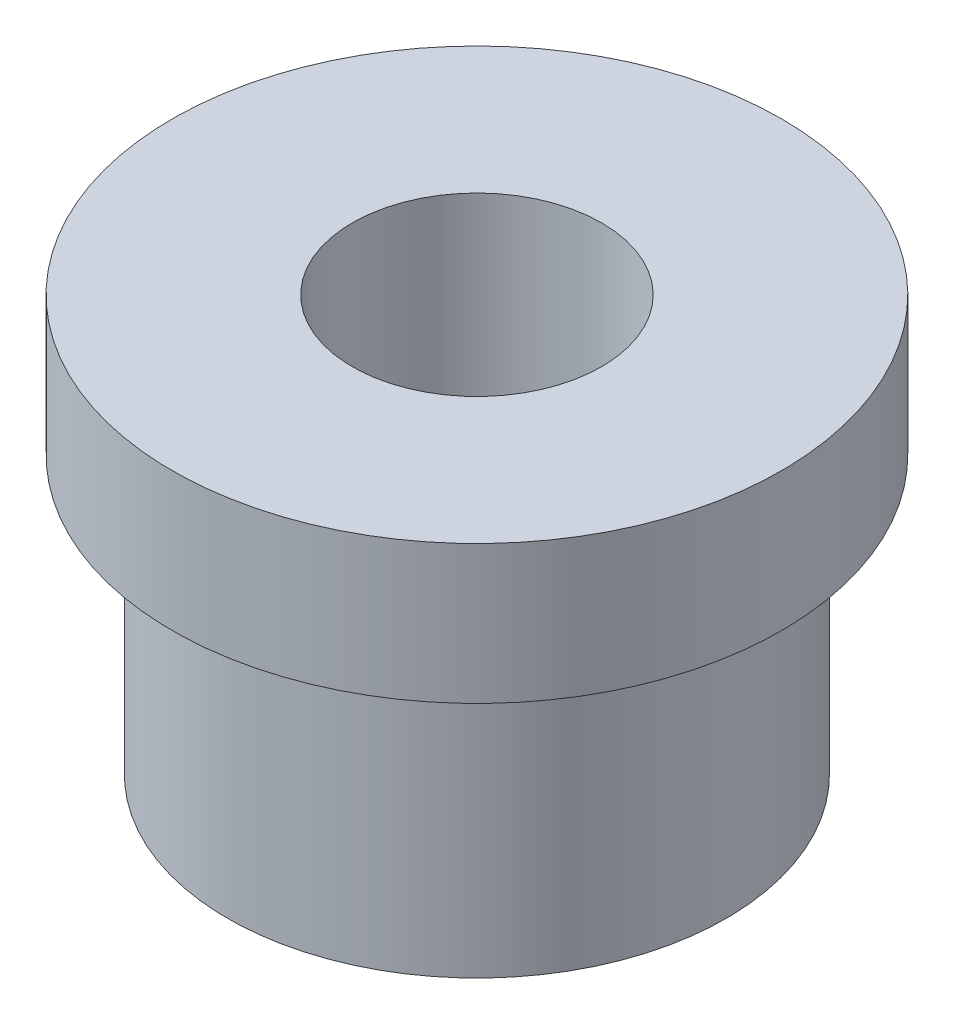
from build123d import *


with BuildPart() as part:
    # Sketch 1 → Revolve 1 (revolve)
    with BuildSketch(Plane.XY, mode=Mode.PRIVATE) as revolve_1_sk:
        Polygon((4.5, 0), (9, 0), (9, 10), (11, 10), (11, 15), (4.5, 15), align=None)
    revolve(revolve_1_sk.sketch.rotate(Axis((0, -3, 0), (0, 1, 0)), 90), axis=Axis((0, -3, 0), (0, 1, 0)))


solid = part.part
